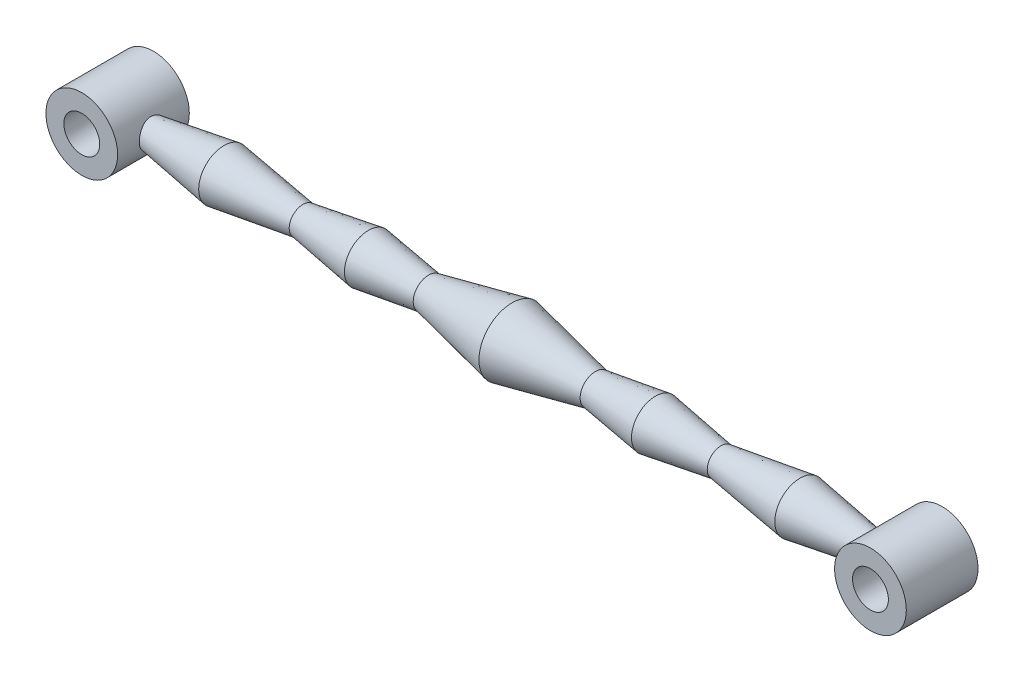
from build123d import *

# Parameters (mm, degrees)
SKETCH1_R          = 6.35
SKETCH1_R_2        = 3.175
BASE_EXTRUDE_DEPTH = 6.35
SKETCH1_3_R        = 3.175
HOLES_DEPTH        = 6.35


with BuildPart() as part:
    # Sketch1 → Base Extrude (new, symmetric)
    # profile 1 of 4: a face of its own
    with BuildSketch(Plane.XY):
        with Locations((-69.85, 0)):
            Circle(SKETCH1_R)
        with Locations((-69.85, 0)):
            Circle(SKETCH1_R_2, mode=Mode.SUBTRACT)
    # profile 2 of 4: a face of its own
    with BuildSketch(Plane.XY):
        with Locations((-69.85, 0)):
            Circle(SKETCH1_R_2)
    # profile 3 of 4: a face of its own
    with BuildSketch(Plane.XY):
        with Locations((69.85, 0)):
            Circle(SKETCH1_R)
        with Locations((69.85, 0)):
            Circle(SKETCH1_R_2, mode=Mode.SUBTRACT)
    # profile 4 of 4: a face of its own
    with BuildSketch(Plane.XY):
        with Locations((69.85, 0)):
            Circle(SKETCH1_R_2)
    extrude(amount=BASE_EXTRUDE_DEPTH, both=True)

    # Sketch1_3 → Holes (cut, symmetric)
    with BuildSketch(Plane.XY):
        with Locations((69.85, 0)):
            Circle(SKETCH1_3_R)
        with Locations((-69.85, 0)):
            Circle(SKETCH1_3_R)
    extrude(amount=HOLES_DEPTH, both=True, mode=Mode.SUBTRACT)

    # Sketch2 → Revolve1 (revolve)
    with BuildSketch(Plane.XY, mode=Mode.PRIVATE) as revolve1_sk:
        Polygon((-63.985701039, 2.435671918), (-51.022840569, 4.468481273), (-37.024327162, 2.435671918), (-25.425868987, 4.254518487), (-14.784122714, 2.709165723), (0, 5.848616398), (14.784122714, 2.709165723), (25.425868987, 4.254518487), (37.024327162, 2.435671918), (51.022840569, 4.468481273), (63.985701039, 2.435671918), (63.985701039, 0), (-63.985701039, 0), align=None)
    revolve(revolve1_sk.sketch.rotate(Axis((-63.985701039, 0, 0), (1, 0, 0)), 90), axis=Axis((-63.985701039, 0, 0), (1, 0, 0)))


solid = part.part
